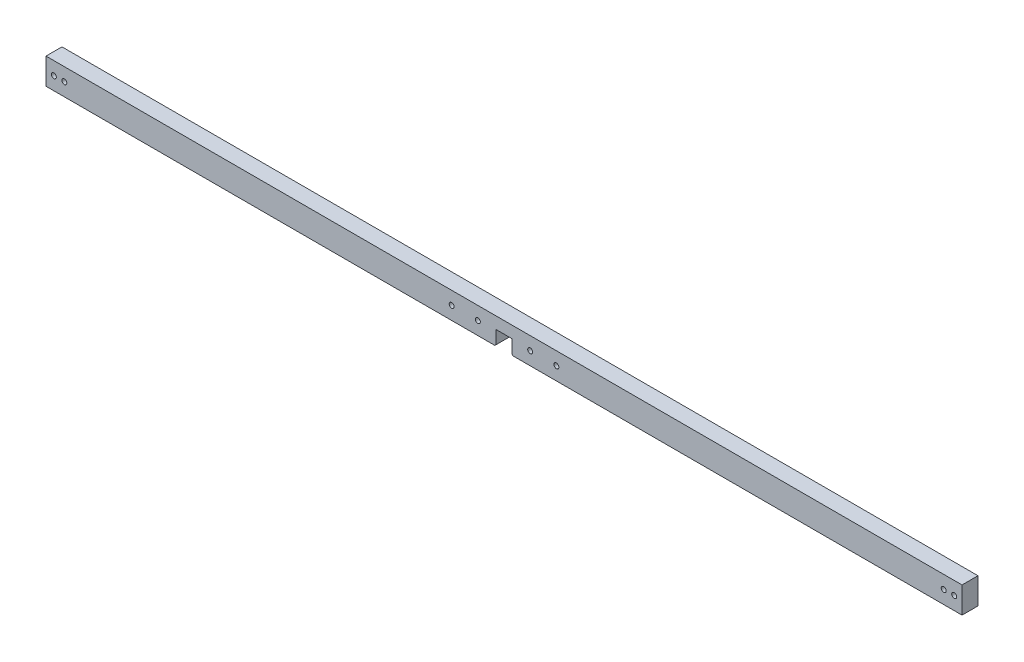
from build123d import *

# Parameters (mm, degrees)
SKETCH1_W           = 350
SKETCH1_H           = 10
BOSS_EXTRUDE1_DEPTH = 3.05
SKETCH2_R           = 0.95
CUT_EXTRUDE1_DEPTH  = 176.177652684
SKETCH4_W           = 6
SKETCH4_H           = 13.062246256
CUT_EXTRUDE2_DEPTH  = 10
CHAMFER1_SIZE       = 0.5


with BuildPart() as part:
    # Sketch1 → Boss-Extrude1 (new, symmetric)
    with BuildSketch(Plane.XY):
        Rectangle(SKETCH1_W, SKETCH1_H)
    extrude(amount=BOSS_EXTRUDE1_DEPTH, both=True)

    # Sketch2 → Cut-Extrude1 (cut, through all)
    with BuildSketch(Plane.XY.offset(3.05)):
        with Locations((10, 0)):
            Circle(SKETCH2_R)
        with Locations((20, 0)):
            Circle(SKETCH2_R)
        with Locations((172, 0)):
            Circle(SKETCH2_R)
        with Locations((168, 0)):
            Circle(SKETCH2_R)
    cut_extrude1 = extrude(amount=-CUT_EXTRUDE1_DEPTH, mode=Mode.SUBTRACT)

    # Mirror1: Cut-Extrude1 across plane
    add(cut_extrude1.mirror(Plane(origin=(0, 0, 0), x_dir=(0, 0, 1), z_dir=(1, 0, 0))), mode=Mode.SUBTRACT)

    # Sketch4 → Cut-Extrude2 (cut)
    with BuildSketch(Plane.XY.offset(3.05)):
        with Locations((0, -6.031123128)):
            Rectangle(SKETCH4_W, SKETCH4_H)
    extrude(amount=-CUT_EXTRUDE2_DEPTH, mode=Mode.SUBTRACT)

    # Chamfer1
    chamfer1_edges = [part.edges().sort_by_distance(p)[0] for p in [
        (3, -5, 0),
        (-3, -5, 0),
    ]]
    chamfer(chamfer1_edges, length=CHAMFER1_SIZE)


solid = part.part
